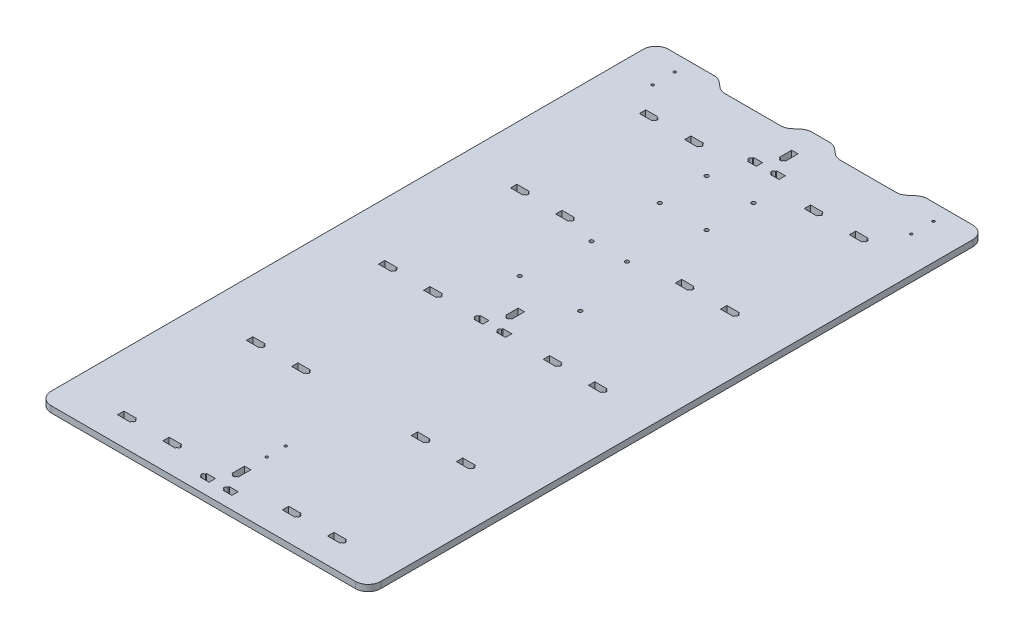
from build123d import *

# Parameters (mm, degrees)
ESQUISSE1_W                = 260
ESQUISSE1_H                = 437
BOSS_EXTRU_1_DEPTH         = 5
ENL_V_MAT_EXTRU_1_DEPTH    = 5
R_P_TITION_LIN_AIRE1_COUNT = 2
R_P_TITION_LIN_AIRE1_PITCH = 130
ESQUISSE3_W                = 260
ESQUISSE3_H                = 5
BOSS_EXTRU_2_DEPTH         = 10
ESQUISSE4_W                = 260
ESQUISSE4_H                = 5
BOSS_EXTRU_3_DEPTH         = 40
ENL_V_MAT_EXTRU_2_DEPTH    = 10
R_P_TITION_LIN_AIRE2_COUNT = 3
R_P_TITION_LIN_AIRE2_PITCH = 215.83
ENL_V_MAT_EXTRU_3_DEPTH    = 10
R_P_TITION_LIN_AIRE3_COUNT = 3
R_P_TITION_LIN_AIRE3_PITCH = 215.83
ESQUISSE8_R                = 1.5
ENL_V_MAT_EXTRU_4_DEPTH    = 10
CONG_2_R                   = 10
ENL_V_MAT_EXTRU_6_DEPTH    = 10
CONG_3_R                   = 10
CONG_3_OF_SYM_TRIE2_R      = 10
ESQUISSE9_R                = 1
ENL_V_MAT_EXTRU_9_DEPTH    = 5
ESQUISSE12_R               = 1.5
ENL_V_MAT_EXTRU_10_DEPTH   = 6
ESQUISSE13_R               = 1
ENL_V_MAT_EXTRU_11_DEPTH   = 10


with BuildPart() as part:
    # Esquisse1 → Boss.-Extru.1 (new body)
    with BuildSketch(Plane(origin=(0, 0, 0), x_dir=(1, 0, 0), z_dir=(0, 1, 0))):
        Rectangle(ESQUISSE1_W, ESQUISSE1_H)
    extrude(amount=BOSS_EXTRU_1_DEPTH)

    # Esquisse2 → Enl_v. mat.-Extru.1 (cut)
    with BuildSketch(Plane(origin=(0, 5, 0), x_dir=(1, 0, 0), z_dir=(0, 1, 0))):
        with BuildLine():
            Line((52.34, -204.531994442), (52.34, -203.5))
            Line((52.34, -203.5), (42.34, -203.5))
            Line((42.34, -203.5), (42.34, -208.5))
            Line((42.34, -208.5), (52.34, -208.5))
            Line((52.34, -208.5), (52.34, -207.468005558))
            ThreePointArc((52.34, -207.468005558), (53.808005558, -206), (52.34, -204.531994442))
        make_face()
        with BuildLine():
            Line((88, -208.5), (78, -208.5))
            Line((78, -208.5), (78, -203.5))
            Line((78, -203.5), (88, -203.5))
            Line((88, -203.5), (88, -204.469124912))
            ThreePointArc((88, -204.469124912), (89.530875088, -206), (88, -207.530875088))
            Line((88, -207.530875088), (88, -208.5))
        make_face()
        with BuildLine():
            Line((52.34, -102.812647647), (52.34, -101.835))
            Line((52.34, -101.835), (42.34, -101.835))
            Line((42.34, -101.835), (42.34, -106.835))
            Line((42.34, -106.835), (52.34, -106.835))
            Line((52.34, -106.835), (52.34, -105.857352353))
            ThreePointArc((52.34, -105.857352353), (53.862352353, -104.335), (52.34, -102.812647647))
        make_face()
        with BuildLine():
            Line((88, -106.835), (78, -106.835))
            Line((78, -106.835), (78, -101.835))
            Line((78, -101.835), (88, -101.835))
            Line((88, -101.835), (88, -102.821500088))
            ThreePointArc((88, -102.821500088), (89.513499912, -104.335), (88, -105.848499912))
            Line((88, -105.848499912), (88, -106.835))
        make_face()
        with BuildLine():
            Line((88, -2.67), (78, -2.67))
            Line((78, -2.67), (78, 2.33))
            Line((78, 2.33), (88, 2.33))
            Line((88, 2.33), (88, 1.280068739))
            ThreePointArc((88, 1.280068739), (89.450068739, -0.17), (88, -1.620068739))
            Line((88, -1.620068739), (88, -2.67))
        make_face()
        with BuildLine():
            Line((52.34, -2.67), (42.34, -2.67))
            Line((42.34, -2.67), (42.34, 2.33))
            Line((42.34, 2.33), (52.34, 2.33))
            Line((52.34, 2.33), (52.34, 1.309787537))
            ThreePointArc((52.34, 1.309787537), (53.819787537, -0.17), (52.34, -1.649787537))
            Line((52.34, -1.649787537), (52.34, -2.67))
        make_face()
        with BuildLine():
            Line((88, 101.495), (78, 101.495))
            Line((78, 101.495), (78, 106.495))
            Line((78, 106.495), (88, 106.495))
            Line((88, 106.495), (88, 105.495))
            ThreePointArc((88, 105.495), (89.5, 103.995), (88, 102.495))
            Line((88, 102.495), (88, 101.495))
        make_face()
        with BuildLine():
            Line((52.34, 101.495), (42.34, 101.495))
            Line((42.34, 101.495), (42.34, 106.495))
            Line((42.34, 106.495), (52.34, 106.495))
            Line((52.34, 106.495), (52.34, 105.495))
            ThreePointArc((52.34, 105.495), (53.84, 103.995), (52.34, 102.495))
            Line((52.34, 102.495), (52.34, 101.495))
        make_face()
        with BuildLine():
            Line((88, 203.16), (78, 203.16))
            Line((78, 203.16), (78, 208.16))
            Line((78, 208.16), (88, 208.16))
            Line((88, 208.16), (88, 207.16))
            ThreePointArc((88, 207.16), (89.5, 205.66), (88, 204.16))
            Line((88, 204.16), (88, 203.16))
        make_face()
        with BuildLine():
            Line((52.34, 203.16), (42.34, 203.16))
            Line((42.34, 203.16), (42.34, 208.16))
            Line((42.34, 208.16), (52.34, 208.16))
            Line((52.34, 208.16), (52.34, 207.16))
            ThreePointArc((52.34, 207.16), (53.84, 205.66), (52.34, 204.16))
            Line((52.34, 204.16), (52.34, 203.16))
        make_face()
    enl_v_mat_extru_1 = extrude(amount=-ENL_V_MAT_EXTRU_1_DEPTH, mode=Mode.SUBTRACT)

    # R_p_tition lin_aire1: Enl_v. mat.-Extru.1 ×2
    with Locations(*[(-i * R_P_TITION_LIN_AIRE1_PITCH, 0, 0) for i in range(1, R_P_TITION_LIN_AIRE1_COUNT)]):
        add(enl_v_mat_extru_1, mode=Mode.SUBTRACT)

    # Esquisse3 → Boss.-Extru.2 (add)
    with BuildSketch(Plane.XY.offset(218.5)):
        with Locations((0, 2.5)):
            Rectangle(ESQUISSE3_W, ESQUISSE3_H)
    extrude(amount=BOSS_EXTRU_2_DEPTH)

    # Esquisse4 → Boss.-Extru.3 (add)
    with BuildSketch(Plane(origin=(0, 0, -218.5), x_dir=(-1, 0, 0), z_dir=(0, 0, -1))):
        with Locations((0, 2.5)):
            Rectangle(ESQUISSE4_W, ESQUISSE4_H)
    extrude(amount=BOSS_EXTRU_3_DEPTH)

    # Esquisse5 → Enl_v. mat.-Extru.2 (cut)
    with BuildSketch(Plane(origin=(0, 5, 0), x_dir=(1, 0, 0), z_dir=(0, 1, 0))):
        with BuildLine():
            Line((5.5, -217.547978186), (5.5, -218.5))
            Line((5.5, -218.5), (12.5, -218.5))
            Line((12.5, -218.5), (12.5, -213.5))
            Line((12.5, -213.5), (5.5, -213.5))
            Line((5.5, -213.5), (5.5, -214.452021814))
            ThreePointArc((5.5, -214.452021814), (3.952021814, -216), (5.5, -217.547978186))
        make_face()
        with BuildLine():
            Line((-12.5, -217.516628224), (-12.5, -218.5))
            Line((-12.5, -218.5), (-5.5, -218.5))
            Line((-5.5, -218.5), (-5.5, -213.5))
            Line((-5.5, -213.5), (-12.5, -213.5))
            Line((-12.5, -213.5), (-12.5, -214.483371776))
            ThreePointArc((-12.5, -214.483371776), (-14.016628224, -216), (-12.5, -217.516628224))
        make_face()
    enl_v_mat_extru_2 = extrude(amount=-ENL_V_MAT_EXTRU_2_DEPTH, mode=Mode.SUBTRACT)

    # R_p_tition lin_aire2: Enl_v. mat.-Extru.2 ×3
    with Locations(*[(0, 0, -i * R_P_TITION_LIN_AIRE2_PITCH) for i in range(1, R_P_TITION_LIN_AIRE2_COUNT)]):
        add(enl_v_mat_extru_2, mode=Mode.SUBTRACT)

    # Esquisse7 → Enl_v. mat.-Extru.3 (cut)
    with BuildSketch(Plane(origin=(0, 5, 0), x_dir=(1, 0, 0), z_dir=(0, 1, 0))):
        with BuildLine():
            Line((2.5, 238.16), (-2.5, 238.16))
            Line((-2.5, 238.16), (-2.5, 228.16))
            Line((-2.5, 228.16), (-1.478418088, 228.16))
            ThreePointArc((-1.478418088, 228.16), (0, 226.681581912), (1.478418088, 228.16))
            Line((1.478418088, 228.16), (2.5, 228.16))
            Line((2.5, 228.16), (2.5, 238.16))
        make_face()
    enl_v_mat_extru_3 = extrude(amount=-ENL_V_MAT_EXTRU_3_DEPTH, mode=Mode.SUBTRACT)

    # R_p_tition lin_aire3: Enl_v. mat.-Extru.3 ×3
    with Locations(*[(0, 0, i * R_P_TITION_LIN_AIRE3_PITCH) for i in range(1, R_P_TITION_LIN_AIRE3_COUNT)]):
        add(enl_v_mat_extru_3, mode=Mode.SUBTRACT)

    # Esquisse8 → Enl_v. mat.-Extru.4 (cut)
    with BuildSketch(Plane.XZ):
        with Locations(Location((-18.5, -150, 0), (0, 0, 270))):
            Circle(ESQUISSE8_R)
        with Locations(Location((18.5, -150, 0), (0, 0, 270))):
            Circle(ESQUISSE8_R)
        with Locations(Location((-18.5, -187, 0), (0, 0, 270))):
            Circle(ESQUISSE8_R)
        with Locations(Location((18.5, -187, 0), (0, 0, 270))):
            Circle(ESQUISSE8_R)
    extrude(amount=-ENL_V_MAT_EXTRU_4_DEPTH, mode=Mode.SUBTRACT)

    # Cong_2
    cong_2_edges = [part.edges().sort_by_distance(p)[0] for p in [
        (130, 2.5, 228.5),
        (-130, 2.5, 228.5),
        (130, 2.5, -258.5),
        (-130, 2.5, -258.5),
    ]]
    fillet(cong_2_edges, radius=CONG_2_R)

    # Esquisse10 → Enl_v. mat.-Extru.6 (cut)
    with BuildSketch(Plane(origin=(0, 5, 0), x_dir=(1, 0, 0), z_dir=(0, 1, 0))):
        Polygon((80.5, 258.5), (70.965971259, 250.5), (20.034028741, 250.5), (10.5, 258.5), align=None)
    enl_v_mat_extru_6 = extrude(amount=-ENL_V_MAT_EXTRU_6_DEPTH, mode=Mode.SUBTRACT)

    # Cong_3
    cong_3_edges = [part.edges().sort_by_distance(p)[0] for p in [
        (10.5, 2.5, -258.5),
        (80.5, 2.5, -258.5),
        (70.965971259, 2.5, -250.5),
        (20.034028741, 2.5, -250.5),
    ]]
    fillet(cong_3_edges, radius=CONG_3_R)

    # Sym_trie2: Enl_v. mat.-Extru.6 across plane
    add(enl_v_mat_extru_6.mirror(Plane(origin=(0, 0, 0), x_dir=(0, 0, 1), z_dir=(1, 0, 0))), mode=Mode.SUBTRACT)

    # Cong_3 of Sym_trie2
    cong_3_of_sym_trie2_edges = [part.edges().sort_by_distance(p)[0] for p in [
        (-10.5, 2.5, -258.5),
        (-80.5, 2.5, -258.5),
        (-70.965971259, 2.5, -250.5),
        (-20.034028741, 2.5, -250.5),
    ]]
    fillet(cong_3_of_sym_trie2_edges, radius=CONG_3_OF_SYM_TRIE2_R)

    # Esquisse9 → Enl_v. mat.-Extru.9 (cut)
    with BuildSketch(Plane.XZ):
        with Locations(Location((102, -245.5, 0), (0, 0, 270))):
            Circle(ESQUISSE9_R)
        with Locations(Location((102, -228, 0), (0, 0, 270))):
            Circle(ESQUISSE9_R)
        with Locations(Location((-102, -245.5, 0), (0, 0, 270))):
            Circle(ESQUISSE9_R)
        with Locations(Location((-102, -228, 0), (0, 0, 270))):
            Circle(ESQUISSE9_R)
    extrude(amount=-ENL_V_MAT_EXTRU_9_DEPTH, mode=Mode.SUBTRACT)

    # Esquisse12 → Enl_v. mat.-Extru.10 (cut)
    with BuildSketch(Plane(origin=(0, 5, 0), x_dir=(1, 0, 0), z_dir=(0, 1, 0))):
        with Locations(Location((23.9, 45, 0), (0, 0, 270))):
            Circle(ESQUISSE12_R)
        with Locations(Location((-23.9, 45, 0), (0, 0, 270))):
            Circle(ESQUISSE12_R)
        with Locations(Location((-19.2, 97, 0), (0, 0, 270))):
            Circle(ESQUISSE12_R)
        with Locations(Location((8.7, 97, 0), (0, 0, 270))):
            Circle(ESQUISSE12_R)
    extrude(amount=-ENL_V_MAT_EXTRU_10_DEPTH, mode=Mode.SUBTRACT)

    # Esquisse13 → Enl_v. mat.-Extru.11 (cut)
    with BuildSketch(Plane(origin=(0, 5, 0), x_dir=(1, 0, 0), z_dir=(0, 1, 0))):
        with Locations(Location((0, -178.5, 0), (0, 0, 270))):
            Circle(ESQUISSE13_R)
        with Locations(Location((0, -163.5, 0), (0, 0, 270))):
            Circle(ESQUISSE13_R)
    extrude(amount=-ENL_V_MAT_EXTRU_11_DEPTH, mode=Mode.SUBTRACT)


solid = part.part
